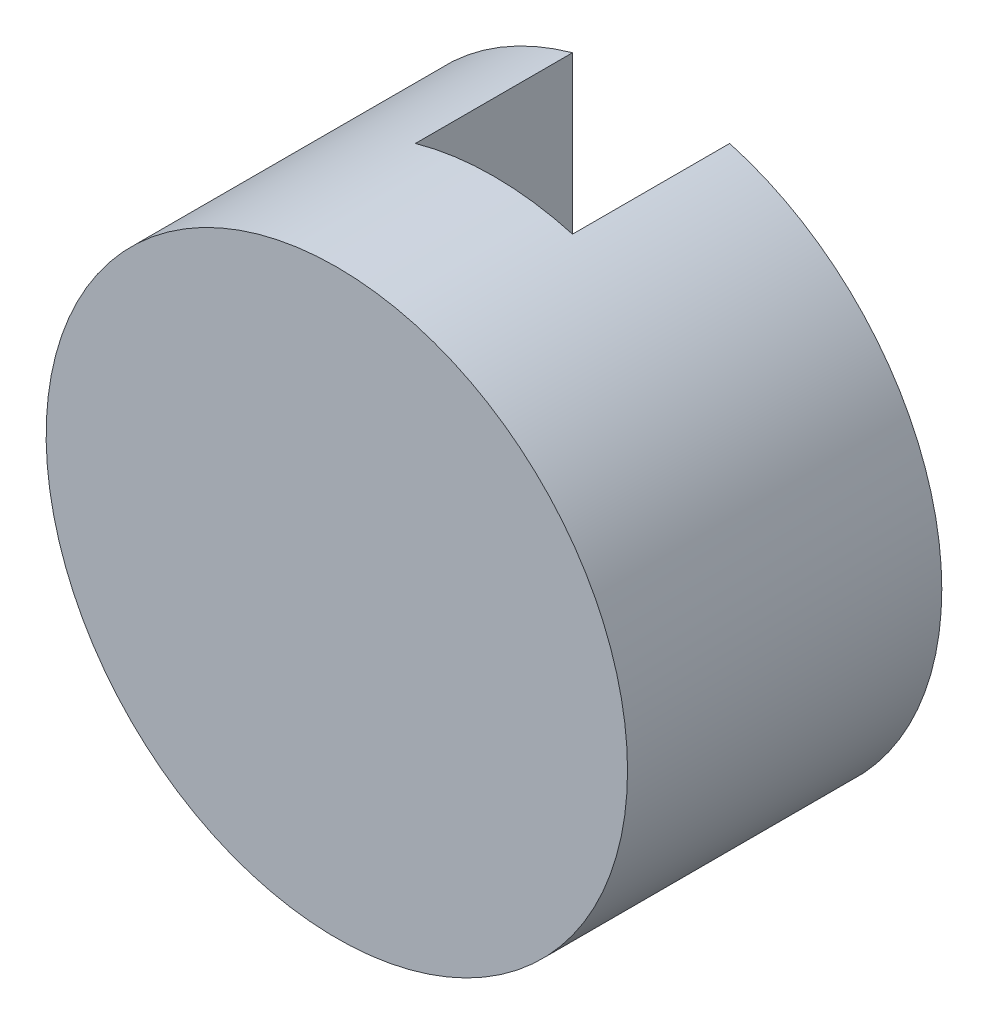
ISO-10303-21;
HEADER;
FILE_DESCRIPTION(('STEP AP214'),'2;1');
FILE_NAME('part.step','',(''),(''),'','','');
FILE_SCHEMA(('AUTOMOTIVE_DESIGN { 1 0 10303 214 1 1 1 1 }'));
ENDSEC;
DATA;
#1=APPLICATION_CONTEXT('core data for automotive mechanical design processes');
#2=APPLICATION_PROTOCOL_DEFINITION('international standard','automotive_design',2000,#1);
#3=PRODUCT_CONTEXT('',#1,'mechanical');
#4=PRODUCT('Part','Part','',(#3));
#5=PRODUCT_RELATED_PRODUCT_CATEGORY('part','',(#4));
#6=PRODUCT_DEFINITION_FORMATION('','',#4);
#7=PRODUCT_DEFINITION_CONTEXT('part definition',#1,'design');
#8=PRODUCT_DEFINITION('design','',#6,#7);
#9=PRODUCT_DEFINITION_SHAPE('','',#8);
#10=(LENGTH_UNIT() NAMED_UNIT(*) SI_UNIT(.MILLI.,.METRE.));
#11=(NAMED_UNIT(*) PLANE_ANGLE_UNIT() SI_UNIT($,.RADIAN.));
#12=(NAMED_UNIT(*) SI_UNIT($,.STERADIAN.) SOLID_ANGLE_UNIT());
#13=UNCERTAINTY_MEASURE_WITH_UNIT(LENGTH_MEASURE(1.E-05),#10,'distance_accuracy_value','');
#14=(GEOMETRIC_REPRESENTATION_CONTEXT(3) GLOBAL_UNCERTAINTY_ASSIGNED_CONTEXT((#13)) GLOBAL_UNIT_ASSIGNED_CONTEXT((#10,
#11,#12)) REPRESENTATION_CONTEXT('',''));
#15=CARTESIAN_POINT('',(0.,0.,0.));
#16=DIRECTION('',(0.,0.,1.));
#17=DIRECTION('',(1.,0.,0.));
#18=AXIS2_PLACEMENT_3D('',#15,#16,#17);
#19=CARTESIAN_POINT('',(-36.8193486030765,12.6460950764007,0.));
#20=DIRECTION('',(0.,0.,1.));
#21=DIRECTION('',(1.,0.,0.));
#22=AXIS2_PLACEMENT_3D('',#19,#20,#21);
#23=PLANE('',#22);
#24=CARTESIAN_POINT('',(-36.8193486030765,12.6460950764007,0.));
#25=DIRECTION('',(0.,0.,1.));
#26=DIRECTION('',(1.,0.,0.));
#27=AXIS2_PLACEMENT_3D('',#24,#25,#26);
#28=CIRCLE('',#27,1.85);
#29=CARTESIAN_POINT('',(-37.3193486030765,14.4272463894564,0.));
#30=VERTEX_POINT('',#29);
#31=CARTESIAN_POINT('',(-37.3193486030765,10.864943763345,0.));
#32=VERTEX_POINT('',#31);
#33=EDGE_CURVE('E94',#30,#32,#28,.T.);
#34=ORIENTED_EDGE('',*,*,#33,.F.);
#35=DIRECTION('',(0.,-1.,0.));
#36=VECTOR('',#35,1.);
#37=CARTESIAN_POINT('',(-37.3193486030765,12.6460950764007,0.));
#38=LINE('',#37,#36);
#39=EDGE_CURVE('E83',#30,#32,#38,.T.);
#40=ORIENTED_EDGE('',*,*,#39,.T.);
#41=EDGE_LOOP('',(#34,#40));
#42=FACE_BOUND('',#41,.T.);
#43=ADVANCED_FACE('F35',(#42),#23,.F.);
#44=CARTESIAN_POINT('',(-36.8193486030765,12.6460950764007,2.));
#45=DIRECTION('',(0.,0.,-1.));
#46=DIRECTION('',(-1.,0.,0.));
#47=AXIS2_PLACEMENT_3D('',#44,#45,#46);
#48=CYLINDRICAL_SURFACE('',#47,1.85);
#49=CARTESIAN_POINT('',(-36.8193486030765,12.6460950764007,1.));
#50=DIRECTION('',(0.,0.,1.));
#51=DIRECTION('',(1.,0.,0.));
#52=AXIS2_PLACEMENT_3D('',#49,#50,#51);
#53=CIRCLE('',#52,1.85);
#54=CARTESIAN_POINT('',(-36.3193486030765,14.4272463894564,1.));
#55=VERTEX_POINT('',#54);
#56=CARTESIAN_POINT('',(-37.3193486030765,14.4272463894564,1.));
#57=VERTEX_POINT('',#56);
#58=EDGE_CURVE('E11',#55,#57,#53,.T.);
#59=ORIENTED_EDGE('',*,*,#58,.T.);
#60=DIRECTION('',(0.,0.,-1.));
#61=VECTOR('',#60,1.);
#62=CARTESIAN_POINT('',(-37.3193486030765,14.4272463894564,2.));
#63=LINE('',#62,#61);
#64=EDGE_CURVE('E58',#57,#30,#63,.T.);
#65=ORIENTED_EDGE('',*,*,#64,.T.);
#66=ORIENTED_EDGE('',*,*,#33,.T.);
#67=DIRECTION('',(0.,0.,-1.));
#68=VECTOR('',#67,1.);
#69=CARTESIAN_POINT('',(-37.3193486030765,10.864943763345,2.));
#70=LINE('',#69,#68);
#71=CARTESIAN_POINT('',(-37.3193486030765,10.864943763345,1.));
#72=VERTEX_POINT('',#71);
#73=EDGE_CURVE('E91',#32,#72,#70,.F.);
#74=ORIENTED_EDGE('',*,*,#73,.T.);
#75=CARTESIAN_POINT('',(-36.3193486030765,10.864943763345,1.));
#76=VERTEX_POINT('',#75);
#77=EDGE_CURVE('E39',#72,#76,#53,.T.);
#78=ORIENTED_EDGE('',*,*,#77,.T.);
#79=DIRECTION('',(0.,0.,-1.));
#80=VECTOR('',#79,1.);
#81=CARTESIAN_POINT('',(-36.3193486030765,10.864943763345,2.));
#82=LINE('',#81,#80);
#83=CARTESIAN_POINT('',(-36.3193486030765,10.864943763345,0.));
#84=VERTEX_POINT('',#83);
#85=EDGE_CURVE('E78',#76,#84,#82,.T.);
#86=ORIENTED_EDGE('',*,*,#85,.T.);
#87=CARTESIAN_POINT('',(-36.3193486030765,14.4272463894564,0.));
#88=VERTEX_POINT('',#87);
#89=EDGE_CURVE('E89',#84,#88,#28,.T.);
#90=ORIENTED_EDGE('',*,*,#89,.T.);
#91=DIRECTION('',(0.,0.,-1.));
#92=VECTOR('',#91,1.);
#93=CARTESIAN_POINT('',(-36.3193486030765,14.4272463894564,2.));
#94=LINE('',#93,#92);
#95=EDGE_CURVE('E50',#88,#55,#94,.F.);
#96=ORIENTED_EDGE('',*,*,#95,.T.);
#97=EDGE_LOOP('',(#59,#65,#66,#74,#78,#86,#90,#96));
#98=FACE_BOUND('',#97,.T.);
#99=CARTESIAN_POINT('',(-36.8193486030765,12.6460950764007,2.));
#100=DIRECTION('',(0.,0.,1.));
#101=DIRECTION('',(1.,0.,0.));
#102=AXIS2_PLACEMENT_3D('',#99,#100,#101);
#103=CIRCLE('',#102,1.85);
#104=CARTESIAN_POINT('',(-34.9693486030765,12.6460950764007,2.));
#105=VERTEX_POINT('',#104);
#106=EDGE_CURVE('E84',#105,#105,#103,.T.);
#107=ORIENTED_EDGE('',*,*,#106,.F.);
#108=EDGE_LOOP('',(#107));
#109=FACE_BOUND('',#108,.T.);
#110=ADVANCED_FACE('F37',(#98,#109),#48,.T.);
#111=CARTESIAN_POINT('',(-36.8193486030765,12.6460950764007,2.));
#112=DIRECTION('',(0.,0.,1.));
#113=DIRECTION('',(1.,0.,0.));
#114=AXIS2_PLACEMENT_3D('',#111,#112,#113);
#115=PLANE('',#114);
#116=ORIENTED_EDGE('',*,*,#106,.T.);
#117=EDGE_LOOP('',(#116));
#118=FACE_BOUND('',#117,.T.);
#119=ADVANCED_FACE('F124',(#118),#115,.T.);
#120=ORIENTED_EDGE('',*,*,#89,.F.);
#121=DIRECTION('',(0.,1.,0.));
#122=VECTOR('',#121,1.);
#123=CARTESIAN_POINT('',(-36.3193486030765,12.6460950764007,0.));
#124=LINE('',#123,#122);
#125=EDGE_CURVE('E75',#84,#88,#124,.T.);
#126=ORIENTED_EDGE('',*,*,#125,.T.);
#127=EDGE_LOOP('',(#120,#126));
#128=FACE_BOUND('',#127,.T.);
#129=ADVANCED_FACE('F93',(#128),#23,.F.);
#130=CARTESIAN_POINT('',(0.,0.,1.));
#131=DIRECTION('',(0.,0.,1.));
#132=DIRECTION('',(1.,0.,0.));
#133=AXIS2_PLACEMENT_3D('',#130,#131,#132);
#134=PLANE('',#133);
#135=DIRECTION('',(0.,-1.,0.));
#136=VECTOR('',#135,1.);
#137=CARTESIAN_POINT('',(-36.3193486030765,15.2637818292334,1.));
#138=LINE('',#137,#136);
#139=EDGE_CURVE('E104',#55,#76,#138,.T.);
#140=ORIENTED_EDGE('',*,*,#139,.T.);
#141=ORIENTED_EDGE('',*,*,#77,.F.);
#142=DIRECTION('',(0.,1.,0.));
#143=VECTOR('',#142,1.);
#144=CARTESIAN_POINT('',(-37.3193486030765,15.2637818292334,1.));
#145=LINE('',#144,#143);
#146=EDGE_CURVE('E105',#72,#57,#145,.T.);
#147=ORIENTED_EDGE('',*,*,#146,.T.);
#148=ORIENTED_EDGE('',*,*,#58,.F.);
#149=EDGE_LOOP('',(#140,#141,#147,#148));
#150=FACE_BOUND('',#149,.T.);
#151=ADVANCED_FACE('F103',(#150),#134,.F.);
#152=CARTESIAN_POINT('',(-37.3193486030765,15.2637818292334,1.));
#153=DIRECTION('',(-1.,0.,0.));
#154=DIRECTION('',(0.,0.,1.));
#155=AXIS2_PLACEMENT_3D('',#152,#153,#154);
#156=PLANE('',#155);
#157=ORIENTED_EDGE('',*,*,#146,.F.);
#158=ORIENTED_EDGE('',*,*,#73,.F.);
#159=ORIENTED_EDGE('',*,*,#39,.F.);
#160=ORIENTED_EDGE('',*,*,#64,.F.);
#161=EDGE_LOOP('',(#157,#158,#159,#160));
#162=FACE_BOUND('',#161,.T.);
#163=ADVANCED_FACE('F110',(#162),#156,.F.);
#164=CARTESIAN_POINT('',(-36.3193486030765,15.2637818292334,1.));
#165=DIRECTION('',(1.,0.,0.));
#166=DIRECTION('',(0.,1.,0.));
#167=AXIS2_PLACEMENT_3D('',#164,#165,#166);
#168=PLANE('',#167);
#169=ORIENTED_EDGE('',*,*,#139,.F.);
#170=ORIENTED_EDGE('',*,*,#95,.F.);
#171=ORIENTED_EDGE('',*,*,#125,.F.);
#172=ORIENTED_EDGE('',*,*,#85,.F.);
#173=EDGE_LOOP('',(#169,#170,#171,#172));
#174=FACE_BOUND('',#173,.T.);
#175=ADVANCED_FACE('F77',(#174),#168,.F.);
#176=CLOSED_SHELL('',(#43,#110,#119,#129,#151,#163,#175));
#177=MANIFOLD_SOLID_BREP('B2',#176);
#178=ADVANCED_BREP_SHAPE_REPRESENTATION('',(#18,#177),#14);
#179=SHAPE_DEFINITION_REPRESENTATION(#9,#178);
ENDSEC;
END-ISO-10303-21;
